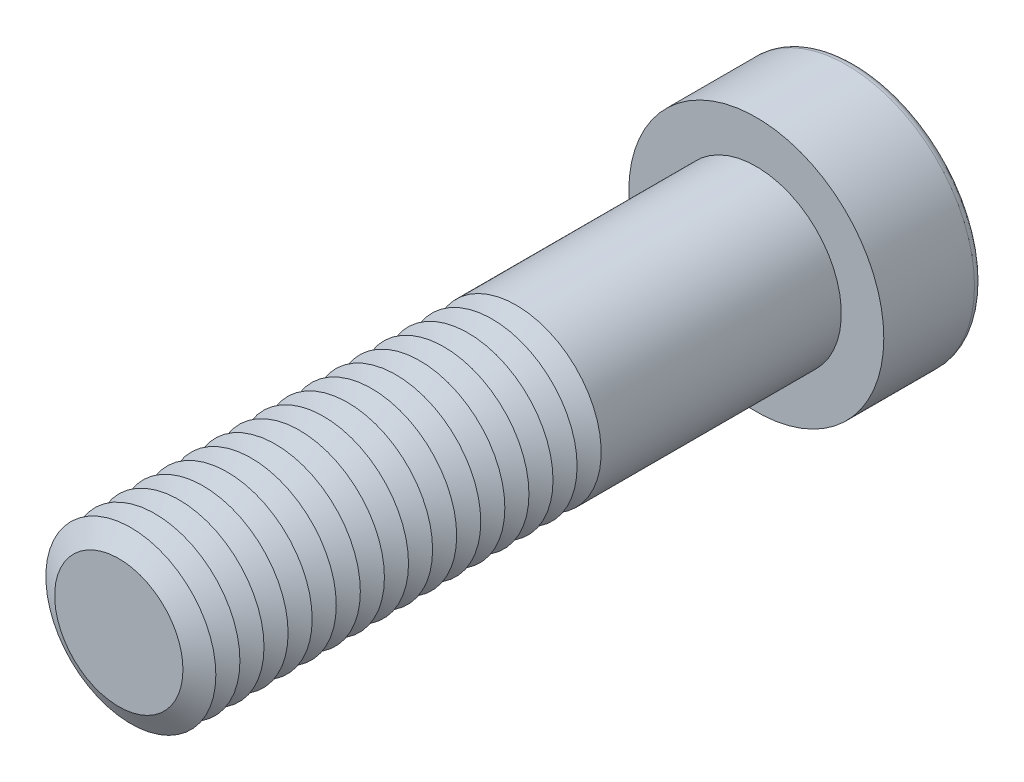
from build123d import *

# Parameters (mm, degrees)
SKETCH1_R           = 6
BOSS_EXTRUDE1_DEPTH = 45
SKETCH2_R           = 9
BOSS_EXTRUDE2_DEPTH = 7
CUT_EXTRUDE1_DEPTH  = 6
FILLET1_R           = 0.6
LPATTERN1_COUNT     = 17
LPATTERN1_PITCH     = 1.7


with BuildPart() as part:
    # Sketch1 → Boss-Extrude1 (new body)
    with BuildSketch(Plane.XY):
        with Locations(Location((0, 0, 0), (0, 0, 180))):
            Circle(SKETCH1_R)
    extrude(amount=BOSS_EXTRUDE1_DEPTH)

    # Sketch2 → Boss-Extrude2 (add)
    with BuildSketch(Plane(origin=(0, 0, 0), x_dir=(-1, 0, 0), z_dir=(0, 0, -1))):
        Circle(SKETCH2_R)
    extrude(amount=BOSS_EXTRUDE2_DEPTH)

    # Sketch3 → Cut-Extrude1 (cut)
    with BuildSketch(Plane(origin=(0, 0, -7), x_dir=(-1, 0, 0), z_dir=(0, 0, -1))):
        Polygon((-2.309401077, 4), (-4.618802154, 0), (-2.309401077, -4), (2.309401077, -4), (4.618802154, 0), (2.309401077, 4), align=None)
    extrude(amount=-CUT_EXTRUDE1_DEPTH, mode=Mode.SUBTRACT)

    # Fillet1
    fillet1_edges = [part.edges().sort_by_distance(p)[0] for p in [
        (9, 0, -7),
    ]]
    fillet(fillet1_edges, radius=FILLET1_R)

    # Cut-Extrude2 cone 1 section (on through the dimple's axis) → Cut-Extrude2 (revolve, cut)
    with BuildSketch(Plane(origin=(0, 0, -1), x_dir=(0, 1, 0), z_dir=(1, 0, 0))):
        Polygon((0, 0), (4, 0), (0, 2.309401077), align=None)
    revolve(axis=Axis((0, 0, -1), (0, 0, 1)), mode=Mode.SUBTRACT)

    # Cut-Extrude3 cone 1 section (on through the dimple's axis) → Cut-Extrude3 (revolve, cut)
    with BuildSketch(Plane(origin=(0, 0, -7), x_dir=(0, 1, 0), z_dir=(1, 0, 0))):
        Polygon((0, 0), (4.618802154, 0), (0, 1.237604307), align=None)
    revolve(axis=Axis((0, 0, -7), (0, 0, 1)), mode=Mode.SUBTRACT)

    # Sketch7 → Cut-Revolve1 (revolve, cut)
    with BuildSketch(Plane(origin=(0, 0, 0), x_dir=(0, 0, -1), z_dir=(1, 0, 0)), mode=Mode.PRIVATE) as cut_revolve1_sk:
        Polygon((-45, 4.527756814), (-44.15, 6), (-45.85, 6), align=None)
    cut_revolve1 = revolve(cut_revolve1_sk.sketch.rotate(Axis((0, 0, 45), (0, 0, -1)), 270), axis=Axis((0, 0, 45), (0, 0, -1)), mode=Mode.SUBTRACT)

    # LPattern1: Cut-Revolve1 ×17
    with Locations(*[(0, 0, -i * LPATTERN1_PITCH) for i in range(1, LPATTERN1_COUNT)]):
        add(cut_revolve1, mode=Mode.SUBTRACT)


solid = part.part
